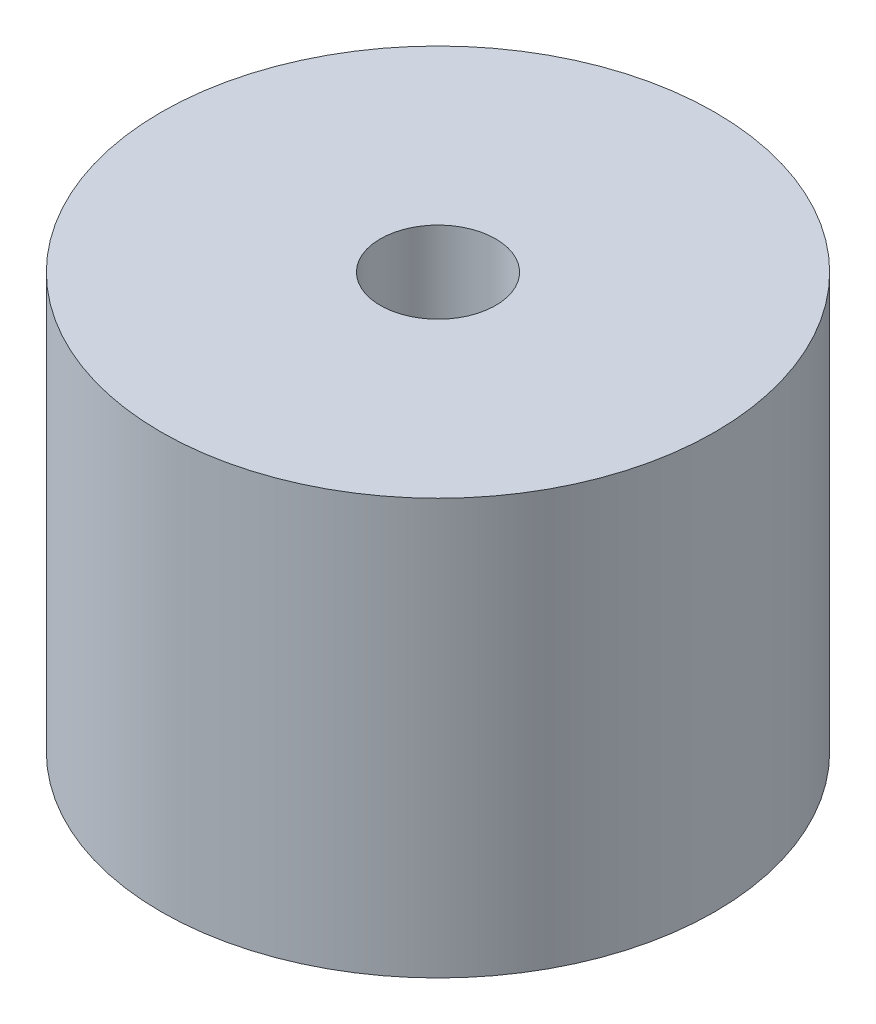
from build123d import *

# Parameters (mm, degrees)
ESQUISSE2_R             = 0.5
ENL_V_MAT_EXTRU_1_DEPTH = 4


with BuildPart() as part:
    # Esquisse1 → R_volution1 (revolve)
    with BuildSketch(Plane.XY, mode=Mode.PRIVATE) as r_volution1_sk:
        Polygon((0.625, 17.806478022), (3, 17.806478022), (3, 13.306478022), (0, 13.306478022), (0, 14), (0.625, 14), align=None)
    revolve(r_volution1_sk.sketch.rotate(Axis((0, 0, 0), (0, 1, 0)), 90), axis=Axis((0, 0, 0), (0, 1, 0)))

    # Esquisse2 → Enl_v. mat.-Extru.1 (cut)
    with BuildSketch(Plane.XZ.offset(-13.306478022)):
        with Locations(Location((2, 0, 0), (0, 0, 270))):
            Circle(ESQUISSE2_R)
    extrude(amount=-ENL_V_MAT_EXTRU_1_DEPTH, mode=Mode.SUBTRACT)


solid = part.part
